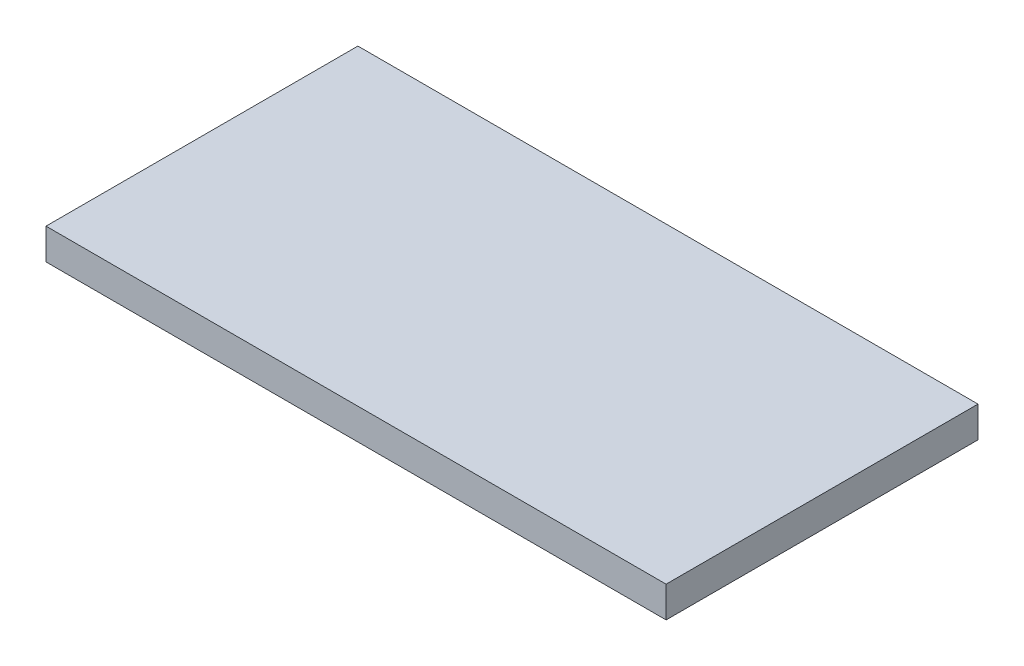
ISO-10303-21;
HEADER;
FILE_DESCRIPTION(('STEP AP214'),'2;1');
FILE_NAME('part.step','',(''),(''),'','','');
FILE_SCHEMA(('AUTOMOTIVE_DESIGN { 1 0 10303 214 1 1 1 1 }'));
ENDSEC;
DATA;
#1=APPLICATION_CONTEXT('core data for automotive mechanical design processes');
#2=APPLICATION_PROTOCOL_DEFINITION('international standard','automotive_design',2000,#1);
#3=PRODUCT_CONTEXT('',#1,'mechanical');
#4=PRODUCT('Part','Part','',(#3));
#5=PRODUCT_RELATED_PRODUCT_CATEGORY('part','',(#4));
#6=PRODUCT_DEFINITION_FORMATION('','',#4);
#7=PRODUCT_DEFINITION_CONTEXT('part definition',#1,'design');
#8=PRODUCT_DEFINITION('design','',#6,#7);
#9=PRODUCT_DEFINITION_SHAPE('','',#8);
#10=(LENGTH_UNIT() NAMED_UNIT(*) SI_UNIT(.MILLI.,.METRE.));
#11=(NAMED_UNIT(*) PLANE_ANGLE_UNIT() SI_UNIT($,.RADIAN.));
#12=(NAMED_UNIT(*) SI_UNIT($,.STERADIAN.) SOLID_ANGLE_UNIT());
#13=UNCERTAINTY_MEASURE_WITH_UNIT(LENGTH_MEASURE(1.E-05),#10,'distance_accuracy_value','');
#14=(GEOMETRIC_REPRESENTATION_CONTEXT(3) GLOBAL_UNCERTAINTY_ASSIGNED_CONTEXT((#13)) GLOBAL_UNIT_ASSIGNED_CONTEXT((#10,
#11,#12)) REPRESENTATION_CONTEXT('',''));
#15=CARTESIAN_POINT('',(0.,0.,0.));
#16=DIRECTION('',(0.,0.,1.));
#17=DIRECTION('',(1.,0.,0.));
#18=AXIS2_PLACEMENT_3D('',#15,#16,#17);
#19=CARTESIAN_POINT('',(-20.2288213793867,-10.,-43.8636887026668));
#20=DIRECTION('',(-1.,0.,0.));
#21=DIRECTION('',(0.,0.,1.));
#22=AXIS2_PLACEMENT_3D('',#19,#20,#21);
#23=PLANE('',#22);
#24=DIRECTION('',(0.,0.,1.));
#25=VECTOR('',#24,1.);
#26=CARTESIAN_POINT('',(-20.2288213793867,0.,-43.8636887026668));
#27=LINE('',#26,#25);
#28=CARTESIAN_POINT('',(-20.2288213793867,0.,-43.8636887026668));
#29=VERTEX_POINT('',#28);
#30=CARTESIAN_POINT('',(-20.2288213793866,0.,56.7622387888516));
#31=VERTEX_POINT('',#30);
#32=EDGE_CURVE('E66',#29,#31,#27,.T.);
#33=ORIENTED_EDGE('',*,*,#32,.F.);
#34=DIRECTION('',(0.,1.,0.));
#35=VECTOR('',#34,1.);
#36=CARTESIAN_POINT('',(-20.2288213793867,-10.,-43.8636887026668));
#37=LINE('',#36,#35);
#38=CARTESIAN_POINT('',(-20.2288213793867,-10.,-43.8636887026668));
#39=VERTEX_POINT('',#38);
#40=EDGE_CURVE('E11',#39,#29,#37,.T.);
#41=ORIENTED_EDGE('',*,*,#40,.F.);
#42=DIRECTION('',(0.,0.,1.));
#43=VECTOR('',#42,1.);
#44=CARTESIAN_POINT('',(-20.2288213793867,-10.,-43.8636887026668));
#45=LINE('',#44,#43);
#46=CARTESIAN_POINT('',(-20.2288213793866,-10.,56.7622387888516));
#47=VERTEX_POINT('',#46);
#48=EDGE_CURVE('E68',#39,#47,#45,.T.);
#49=ORIENTED_EDGE('',*,*,#48,.T.);
#50=DIRECTION('',(0.,1.,0.));
#51=VECTOR('',#50,1.);
#52=CARTESIAN_POINT('',(-20.2288213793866,-10.,56.7622387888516));
#53=LINE('',#52,#51);
#54=EDGE_CURVE('E29',#47,#31,#53,.T.);
#55=ORIENTED_EDGE('',*,*,#54,.T.);
#56=EDGE_LOOP('',(#33,#41,#49,#55));
#57=FACE_BOUND('',#56,.T.);
#58=ADVANCED_FACE('F26',(#57),#23,.T.);
#59=CARTESIAN_POINT('',(-20.2288213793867,-10.,-43.8636887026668));
#60=DIRECTION('',(0.,0.,-1.));
#61=DIRECTION('',(-1.,0.,0.));
#62=AXIS2_PLACEMENT_3D('',#59,#60,#61);
#63=PLANE('',#62);
#64=DIRECTION('',(-1.,0.,0.));
#65=VECTOR('',#64,1.);
#66=CARTESIAN_POINT('',(-20.2288213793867,0.,-43.8636887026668));
#67=LINE('',#66,#65);
#68=CARTESIAN_POINT('',(179.829390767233,0.,-43.8636887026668));
#69=VERTEX_POINT('',#68);
#70=EDGE_CURVE('E83',#69,#29,#67,.T.);
#71=ORIENTED_EDGE('',*,*,#70,.F.);
#72=DIRECTION('',(0.,1.,0.));
#73=VECTOR('',#72,1.);
#74=CARTESIAN_POINT('',(179.829390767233,-10.,-43.8636887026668));
#75=LINE('',#74,#73);
#76=CARTESIAN_POINT('',(179.829390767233,-10.,-43.8636887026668));
#77=VERTEX_POINT('',#76);
#78=EDGE_CURVE('E34',#77,#69,#75,.T.);
#79=ORIENTED_EDGE('',*,*,#78,.F.);
#80=DIRECTION('',(-1.,0.,0.));
#81=VECTOR('',#80,1.);
#82=CARTESIAN_POINT('',(-20.2288213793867,-10.,-43.8636887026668));
#83=LINE('',#82,#81);
#84=EDGE_CURVE('E73',#77,#39,#83,.T.);
#85=ORIENTED_EDGE('',*,*,#84,.T.);
#86=ORIENTED_EDGE('',*,*,#40,.T.);
#87=EDGE_LOOP('',(#71,#79,#85,#86));
#88=FACE_BOUND('',#87,.T.);
#89=ADVANCED_FACE('F98',(#88),#63,.T.);
#90=CARTESIAN_POINT('',(179.829390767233,-10.,-43.8636887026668));
#91=DIRECTION('',(1.,0.,0.));
#92=DIRECTION('',(0.,0.,-1.));
#93=AXIS2_PLACEMENT_3D('',#90,#91,#92);
#94=PLANE('',#93);
#95=DIRECTION('',(0.,0.,-1.));
#96=VECTOR('',#95,1.);
#97=CARTESIAN_POINT('',(179.829390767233,0.,-43.8636887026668));
#98=LINE('',#97,#96);
#99=CARTESIAN_POINT('',(179.829390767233,0.,56.7622387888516));
#100=VERTEX_POINT('',#99);
#101=EDGE_CURVE('E80',#100,#69,#98,.T.);
#102=ORIENTED_EDGE('',*,*,#101,.F.);
#103=DIRECTION('',(0.,1.,0.));
#104=VECTOR('',#103,1.);
#105=CARTESIAN_POINT('',(179.829390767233,-10.,56.7622387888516));
#106=LINE('',#105,#104);
#107=CARTESIAN_POINT('',(179.829390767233,-10.,56.7622387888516));
#108=VERTEX_POINT('',#107);
#109=EDGE_CURVE('E72',#108,#100,#106,.T.);
#110=ORIENTED_EDGE('',*,*,#109,.F.);
#111=DIRECTION('',(0.,0.,-1.));
#112=VECTOR('',#111,1.);
#113=CARTESIAN_POINT('',(179.829390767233,-10.,-43.8636887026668));
#114=LINE('',#113,#112);
#115=EDGE_CURVE('E91',#108,#77,#114,.T.);
#116=ORIENTED_EDGE('',*,*,#115,.T.);
#117=ORIENTED_EDGE('',*,*,#78,.T.);
#118=EDGE_LOOP('',(#102,#110,#116,#117));
#119=FACE_BOUND('',#118,.T.);
#120=ADVANCED_FACE('F95',(#119),#94,.T.);
#121=CARTESIAN_POINT('',(-20.2288213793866,-10.,56.7622387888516));
#122=DIRECTION('',(0.,0.,1.));
#123=DIRECTION('',(1.,0.,0.));
#124=AXIS2_PLACEMENT_3D('',#121,#122,#123);
#125=PLANE('',#124);
#126=DIRECTION('',(1.,0.,0.));
#127=VECTOR('',#126,1.);
#128=CARTESIAN_POINT('',(-20.2288213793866,0.,56.7622387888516));
#129=LINE('',#128,#127);
#130=EDGE_CURVE('E75',#31,#100,#129,.T.);
#131=ORIENTED_EDGE('',*,*,#130,.F.);
#132=ORIENTED_EDGE('',*,*,#54,.F.);
#133=DIRECTION('',(1.,0.,0.));
#134=VECTOR('',#133,1.);
#135=CARTESIAN_POINT('',(-20.2288213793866,-10.,56.7622387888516));
#136=LINE('',#135,#134);
#137=EDGE_CURVE('E89',#47,#108,#136,.T.);
#138=ORIENTED_EDGE('',*,*,#137,.T.);
#139=ORIENTED_EDGE('',*,*,#109,.T.);
#140=EDGE_LOOP('',(#131,#132,#138,#139));
#141=FACE_BOUND('',#140,.T.);
#142=ADVANCED_FACE('F76',(#141),#125,.T.);
#143=CARTESIAN_POINT('',(-20.2288213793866,-10.,56.7622387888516));
#144=DIRECTION('',(0.,1.,0.));
#145=DIRECTION('',(0.,0.,1.));
#146=AXIS2_PLACEMENT_3D('',#143,#144,#145);
#147=PLANE('',#146);
#148=ORIENTED_EDGE('',*,*,#48,.F.);
#149=ORIENTED_EDGE('',*,*,#84,.F.);
#150=ORIENTED_EDGE('',*,*,#115,.F.);
#151=ORIENTED_EDGE('',*,*,#137,.F.);
#152=EDGE_LOOP('',(#148,#149,#150,#151));
#153=FACE_BOUND('',#152,.T.);
#154=ADVANCED_FACE('F100',(#153),#147,.F.);
#155=CARTESIAN_POINT('',(-20.2288213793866,0.,56.7622387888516));
#156=DIRECTION('',(0.,1.,0.));
#157=DIRECTION('',(0.,0.,1.));
#158=AXIS2_PLACEMENT_3D('',#155,#156,#157);
#159=PLANE('',#158);
#160=ORIENTED_EDGE('',*,*,#32,.T.);
#161=ORIENTED_EDGE('',*,*,#130,.T.);
#162=ORIENTED_EDGE('',*,*,#101,.T.);
#163=ORIENTED_EDGE('',*,*,#70,.T.);
#164=EDGE_LOOP('',(#160,#161,#162,#163));
#165=FACE_BOUND('',#164,.T.);
#166=ADVANCED_FACE('F82',(#165),#159,.T.);
#167=CLOSED_SHELL('',(#58,#89,#120,#142,#154,#166));
#168=MANIFOLD_SOLID_BREP('B2',#167);
#169=ADVANCED_BREP_SHAPE_REPRESENTATION('',(#18,#168),#14);
#170=SHAPE_DEFINITION_REPRESENTATION(#9,#169);
ENDSEC;
END-ISO-10303-21;
